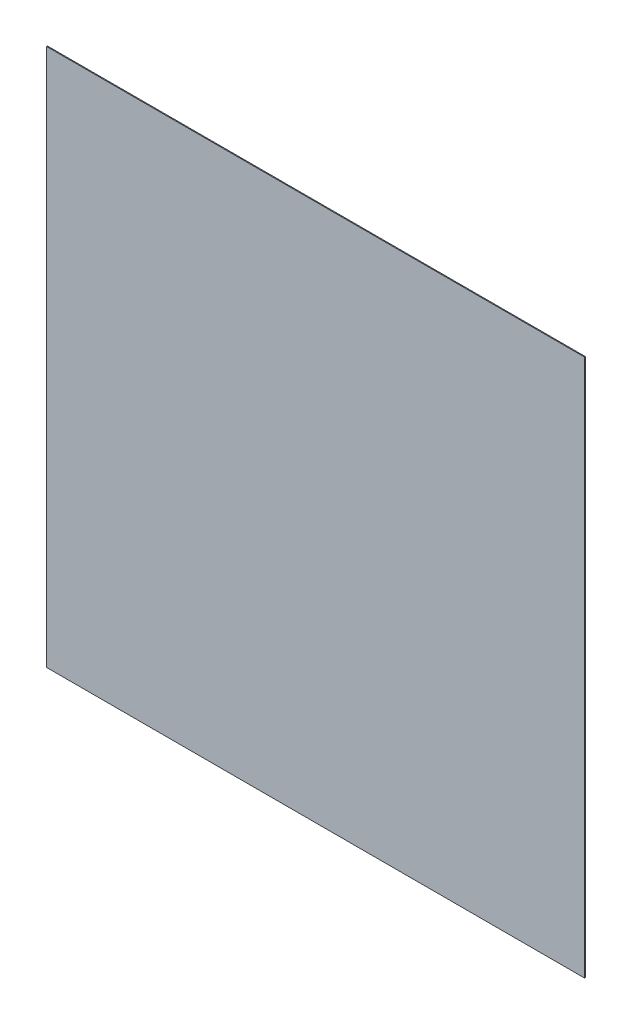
ISO-10303-21;
HEADER;
FILE_DESCRIPTION(('STEP AP214'),'2;1');
FILE_NAME('part.step','',(''),(''),'','','');
FILE_SCHEMA(('AUTOMOTIVE_DESIGN { 1 0 10303 214 1 1 1 1 }'));
ENDSEC;
DATA;
#1=APPLICATION_CONTEXT('core data for automotive mechanical design processes');
#2=APPLICATION_PROTOCOL_DEFINITION('international standard','automotive_design',2000,#1);
#3=PRODUCT_CONTEXT('',#1,'mechanical');
#4=PRODUCT('Part','Part','',(#3));
#5=PRODUCT_RELATED_PRODUCT_CATEGORY('part','',(#4));
#6=PRODUCT_DEFINITION_FORMATION('','',#4);
#7=PRODUCT_DEFINITION_CONTEXT('part definition',#1,'design');
#8=PRODUCT_DEFINITION('design','',#6,#7);
#9=PRODUCT_DEFINITION_SHAPE('','',#8);
#10=(LENGTH_UNIT() NAMED_UNIT(*) SI_UNIT(.MILLI.,.METRE.));
#11=(NAMED_UNIT(*) PLANE_ANGLE_UNIT() SI_UNIT($,.RADIAN.));
#12=(NAMED_UNIT(*) SI_UNIT($,.STERADIAN.) SOLID_ANGLE_UNIT());
#13=UNCERTAINTY_MEASURE_WITH_UNIT(LENGTH_MEASURE(1.E-05),#10,'distance_accuracy_value','');
#14=(GEOMETRIC_REPRESENTATION_CONTEXT(3) GLOBAL_UNCERTAINTY_ASSIGNED_CONTEXT((#13)) GLOBAL_UNIT_ASSIGNED_CONTEXT((#10,
#11,#12)) REPRESENTATION_CONTEXT('',''));
#15=CARTESIAN_POINT('',(0.,0.,0.));
#16=DIRECTION('',(0.,0.,1.));
#17=DIRECTION('',(1.,0.,0.));
#18=AXIS2_PLACEMENT_3D('',#15,#16,#17);
#19=CARTESIAN_POINT('',(0.,0.,0.01));
#20=DIRECTION('',(0.,0.,1.));
#21=DIRECTION('',(1.,0.,0.));
#22=AXIS2_PLACEMENT_3D('',#19,#20,#21);
#23=PLANE('',#22);
#24=DIRECTION('',(1.,0.,0.));
#25=VECTOR('',#24,1.);
#26=CARTESIAN_POINT('',(6.,6.,0.01));
#27=LINE('',#26,#25);
#28=CARTESIAN_POINT('',(0.,6.,0.01));
#29=VERTEX_POINT('',#28);
#30=CARTESIAN_POINT('',(6.,6.,0.01));
#31=VERTEX_POINT('',#30);
#32=EDGE_CURVE('E67',#29,#31,#27,.T.);
#33=ORIENTED_EDGE('',*,*,#32,.F.);
#34=DIRECTION('',(0.,1.,0.));
#35=VECTOR('',#34,1.);
#36=CARTESIAN_POINT('',(0.,6.,0.01));
#37=LINE('',#36,#35);
#38=CARTESIAN_POINT('',(0.,0.,0.01));
#39=VERTEX_POINT('',#38);
#40=EDGE_CURVE('E19',#39,#29,#37,.T.);
#41=ORIENTED_EDGE('',*,*,#40,.F.);
#42=DIRECTION('',(1.,0.,0.));
#43=VECTOR('',#42,1.);
#44=CARTESIAN_POINT('',(0.,0.,0.01));
#45=LINE('',#44,#43);
#46=CARTESIAN_POINT('',(6.,0.,0.01));
#47=VERTEX_POINT('',#46);
#48=EDGE_CURVE('E57',#47,#39,#45,.F.);
#49=ORIENTED_EDGE('',*,*,#48,.F.);
#50=DIRECTION('',(0.,1.,0.));
#51=VECTOR('',#50,1.);
#52=CARTESIAN_POINT('',(6.,0.,0.01));
#53=LINE('',#52,#51);
#54=EDGE_CURVE('E52',#31,#47,#53,.F.);
#55=ORIENTED_EDGE('',*,*,#54,.F.);
#56=EDGE_LOOP('',(#33,#41,#49,#55));
#57=FACE_BOUND('',#56,.T.);
#58=ADVANCED_FACE('F16',(#57),#23,.T.);
#59=CARTESIAN_POINT('',(0.,6.,0.));
#60=DIRECTION('',(-1.,0.,0.));
#61=DIRECTION('',(0.,0.,1.));
#62=AXIS2_PLACEMENT_3D('',#59,#60,#61);
#63=PLANE('',#62);
#64=DIRECTION('',(0.,0.,1.));
#65=VECTOR('',#64,1.);
#66=CARTESIAN_POINT('',(0.,6.,0.));
#67=LINE('',#66,#65);
#68=CARTESIAN_POINT('',(0.,6.,0.));
#69=VERTEX_POINT('',#68);
#70=EDGE_CURVE('E78',#69,#29,#67,.T.);
#71=ORIENTED_EDGE('',*,*,#70,.F.);
#72=DIRECTION('',(0.,1.,0.));
#73=VECTOR('',#72,1.);
#74=CARTESIAN_POINT('',(0.,0.,0.));
#75=LINE('',#74,#73);
#76=CARTESIAN_POINT('',(0.,0.,0.));
#77=VERTEX_POINT('',#76);
#78=EDGE_CURVE('E73',#69,#77,#75,.F.);
#79=ORIENTED_EDGE('',*,*,#78,.T.);
#80=DIRECTION('',(0.,0.,-1.));
#81=VECTOR('',#80,1.);
#82=CARTESIAN_POINT('',(0.,0.,0.));
#83=LINE('',#82,#81);
#84=EDGE_CURVE('E62',#39,#77,#83,.T.);
#85=ORIENTED_EDGE('',*,*,#84,.F.);
#86=ORIENTED_EDGE('',*,*,#40,.T.);
#87=EDGE_LOOP('',(#71,#79,#85,#86));
#88=FACE_BOUND('',#87,.T.);
#89=ADVANCED_FACE('F72',(#88),#63,.T.);
#90=CARTESIAN_POINT('',(0.,0.,0.));
#91=DIRECTION('',(0.,-1.,0.));
#92=DIRECTION('',(0.,0.,-1.));
#93=AXIS2_PLACEMENT_3D('',#90,#91,#92);
#94=PLANE('',#93);
#95=ORIENTED_EDGE('',*,*,#84,.T.);
#96=DIRECTION('',(1.,0.,0.));
#97=VECTOR('',#96,1.);
#98=CARTESIAN_POINT('',(0.,0.,0.));
#99=LINE('',#98,#97);
#100=CARTESIAN_POINT('',(6.,0.,0.));
#101=VERTEX_POINT('',#100);
#102=EDGE_CURVE('E83',#77,#101,#99,.T.);
#103=ORIENTED_EDGE('',*,*,#102,.T.);
#104=DIRECTION('',(0.,0.,-1.));
#105=VECTOR('',#104,1.);
#106=CARTESIAN_POINT('',(6.,0.,0.));
#107=LINE('',#106,#105);
#108=EDGE_CURVE('E64',#47,#101,#107,.T.);
#109=ORIENTED_EDGE('',*,*,#108,.F.);
#110=ORIENTED_EDGE('',*,*,#48,.T.);
#111=EDGE_LOOP('',(#95,#103,#109,#110));
#112=FACE_BOUND('',#111,.T.);
#113=ADVANCED_FACE('F59',(#112),#94,.T.);
#114=CARTESIAN_POINT('',(6.,0.,0.));
#115=DIRECTION('',(1.,0.,0.));
#116=DIRECTION('',(0.,0.,-1.));
#117=AXIS2_PLACEMENT_3D('',#114,#115,#116);
#118=PLANE('',#117);
#119=ORIENTED_EDGE('',*,*,#108,.T.);
#120=DIRECTION('',(0.,1.,0.));
#121=VECTOR('',#120,1.);
#122=CARTESIAN_POINT('',(6.,0.,0.));
#123=LINE('',#122,#121);
#124=CARTESIAN_POINT('',(6.,6.,0.));
#125=VERTEX_POINT('',#124);
#126=EDGE_CURVE('E25',#101,#125,#123,.T.);
#127=ORIENTED_EDGE('',*,*,#126,.T.);
#128=DIRECTION('',(0.,0.,1.));
#129=VECTOR('',#128,1.);
#130=CARTESIAN_POINT('',(6.,6.,0.));
#131=LINE('',#130,#129);
#132=EDGE_CURVE('E33',#31,#125,#131,.F.);
#133=ORIENTED_EDGE('',*,*,#132,.F.);
#134=ORIENTED_EDGE('',*,*,#54,.T.);
#135=EDGE_LOOP('',(#119,#127,#133,#134));
#136=FACE_BOUND('',#135,.T.);
#137=ADVANCED_FACE('F87',(#136),#118,.T.);
#138=CARTESIAN_POINT('',(6.,6.,0.));
#139=DIRECTION('',(0.,1.,0.));
#140=DIRECTION('',(0.,0.,1.));
#141=AXIS2_PLACEMENT_3D('',#138,#139,#140);
#142=PLANE('',#141);
#143=ORIENTED_EDGE('',*,*,#132,.T.);
#144=DIRECTION('',(1.,0.,0.));
#145=VECTOR('',#144,1.);
#146=CARTESIAN_POINT('',(0.,6.,0.));
#147=LINE('',#146,#145);
#148=EDGE_CURVE('E11',#125,#69,#147,.F.);
#149=ORIENTED_EDGE('',*,*,#148,.T.);
#150=ORIENTED_EDGE('',*,*,#70,.T.);
#151=ORIENTED_EDGE('',*,*,#32,.T.);
#152=EDGE_LOOP('',(#143,#149,#150,#151));
#153=FACE_BOUND('',#152,.T.);
#154=ADVANCED_FACE('F90',(#153),#142,.T.);
#155=CARTESIAN_POINT('',(0.,0.,0.));
#156=DIRECTION('',(0.,0.,1.));
#157=DIRECTION('',(1.,0.,0.));
#158=AXIS2_PLACEMENT_3D('',#155,#156,#157);
#159=PLANE('',#158);
#160=ORIENTED_EDGE('',*,*,#126,.F.);
#161=ORIENTED_EDGE('',*,*,#102,.F.);
#162=ORIENTED_EDGE('',*,*,#78,.F.);
#163=ORIENTED_EDGE('',*,*,#148,.F.);
#164=EDGE_LOOP('',(#160,#161,#162,#163));
#165=FACE_BOUND('',#164,.T.);
#166=ADVANCED_FACE('F89',(#165),#159,.F.);
#167=CLOSED_SHELL('',(#58,#89,#113,#137,#154,#166));
#168=MANIFOLD_SOLID_BREP('B1',#167);
#169=ADVANCED_BREP_SHAPE_REPRESENTATION('',(#18,#168),#14);
#170=SHAPE_DEFINITION_REPRESENTATION(#9,#169);
ENDSEC;
END-ISO-10303-21;
